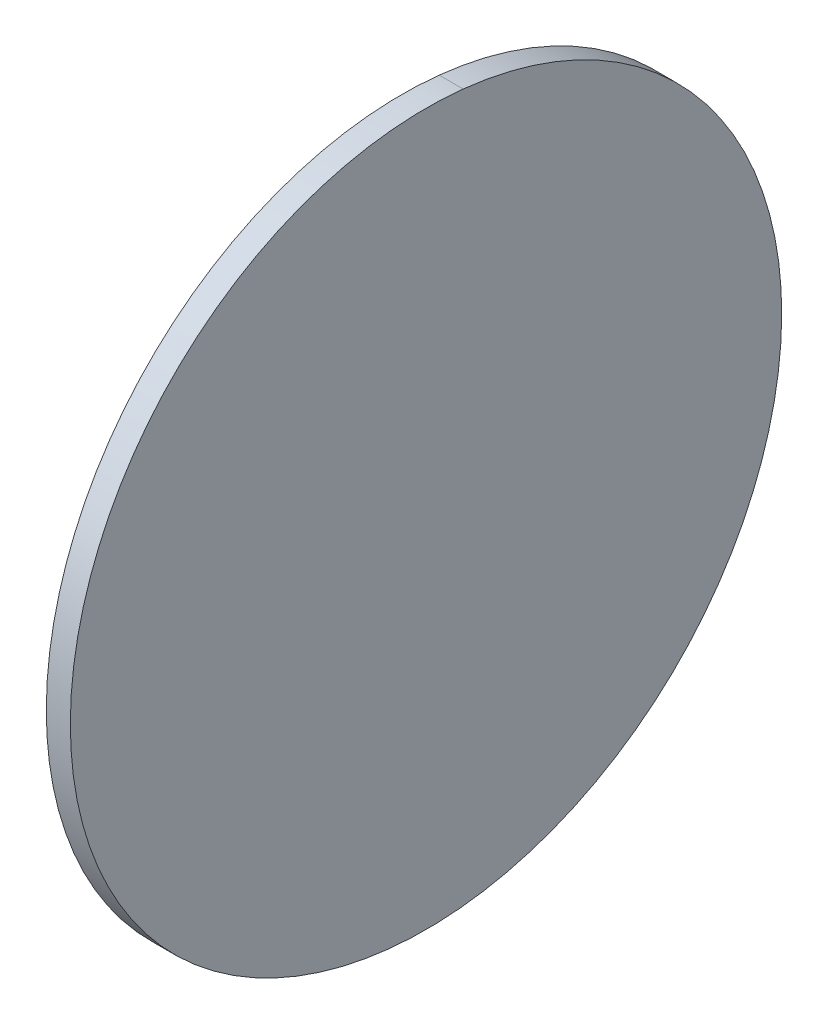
ISO-10303-21;
HEADER;
FILE_DESCRIPTION(('STEP AP214'),'2;1');
FILE_NAME('part.step','',(''),(''),'','','');
FILE_SCHEMA(('AUTOMOTIVE_DESIGN { 1 0 10303 214 1 1 1 1 }'));
ENDSEC;
DATA;
#1=APPLICATION_CONTEXT('core data for automotive mechanical design processes');
#2=APPLICATION_PROTOCOL_DEFINITION('international standard','automotive_design',2000,#1);
#3=PRODUCT_CONTEXT('',#1,'mechanical');
#4=PRODUCT('Part','Part','',(#3));
#5=PRODUCT_RELATED_PRODUCT_CATEGORY('part','',(#4));
#6=PRODUCT_DEFINITION_FORMATION('','',#4);
#7=PRODUCT_DEFINITION_CONTEXT('part definition',#1,'design');
#8=PRODUCT_DEFINITION('design','',#6,#7);
#9=PRODUCT_DEFINITION_SHAPE('','',#8);
#10=(LENGTH_UNIT() NAMED_UNIT(*) SI_UNIT(.MILLI.,.METRE.));
#11=(NAMED_UNIT(*) PLANE_ANGLE_UNIT() SI_UNIT($,.RADIAN.));
#12=(NAMED_UNIT(*) SI_UNIT($,.STERADIAN.) SOLID_ANGLE_UNIT());
#13=UNCERTAINTY_MEASURE_WITH_UNIT(LENGTH_MEASURE(1.E-05),#10,'distance_accuracy_value','');
#14=(GEOMETRIC_REPRESENTATION_CONTEXT(3) GLOBAL_UNCERTAINTY_ASSIGNED_CONTEXT((#13)) GLOBAL_UNIT_ASSIGNED_CONTEXT((#10,
#11,#12)) REPRESENTATION_CONTEXT('',''));
#15=CARTESIAN_POINT('',(0.,0.,0.));
#16=DIRECTION('',(0.,0.,1.));
#17=DIRECTION('',(1.,0.,0.));
#18=AXIS2_PLACEMENT_3D('',#15,#16,#17);
#19=CARTESIAN_POINT('',(82.1,0.,0.));
#20=DIRECTION('',(-1.,0.,0.));
#21=DIRECTION('',(0.,0.994521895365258,-0.104528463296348));
#22=AXIS2_PLACEMENT_3D('',#19,#20,#21);
#23=CYLINDRICAL_SURFACE('',#22,7.4);
#24=DIRECTION('',(-1.,0.,0.));
#25=VECTOR('',#24,1.);
#26=CARTESIAN_POINT('',(82.1,7.35946202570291,-0.773510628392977));
#27=LINE('',#26,#25);
#28=CARTESIAN_POINT('',(82.35,7.35946202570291,-0.773510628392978));
#29=VERTEX_POINT('',#28);
#30=CARTESIAN_POINT('',(81.85,7.35946202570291,-0.773510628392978));
#31=VERTEX_POINT('',#30);
#32=EDGE_CURVE('E11',#29,#31,#27,.T.);
#33=ORIENTED_EDGE('',*,*,#32,.F.);
#34=CARTESIAN_POINT('',(82.35,0.,0.));
#35=DIRECTION('',(1.,0.,0.));
#36=DIRECTION('',(0.,0.994521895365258,-0.104528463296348));
#37=AXIS2_PLACEMENT_3D('',#34,#35,#36);
#38=CIRCLE('',#37,7.4);
#39=CARTESIAN_POINT('',(82.35,-7.35946202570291,0.773510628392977));
#40=VERTEX_POINT('',#39);
#41=EDGE_CURVE('E37',#40,#29,#38,.T.);
#42=ORIENTED_EDGE('',*,*,#41,.F.);
#43=DIRECTION('',(1.,0.,0.));
#44=VECTOR('',#43,1.);
#45=CARTESIAN_POINT('',(82.1,-7.35946202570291,0.773510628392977));
#46=LINE('',#45,#44);
#47=CARTESIAN_POINT('',(81.85,-7.35946202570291,0.773510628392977));
#48=VERTEX_POINT('',#47);
#49=EDGE_CURVE('E20',#48,#40,#46,.T.);
#50=ORIENTED_EDGE('',*,*,#49,.F.);
#51=CARTESIAN_POINT('',(81.85,0.,0.));
#52=DIRECTION('',(-1.,0.,0.));
#53=DIRECTION('',(0.,0.994521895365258,-0.104528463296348));
#54=AXIS2_PLACEMENT_3D('',#51,#52,#53);
#55=CIRCLE('',#54,7.4);
#56=EDGE_CURVE('E53',#31,#48,#55,.T.);
#57=ORIENTED_EDGE('',*,*,#56,.F.);
#58=EDGE_LOOP('',(#33,#42,#50,#57));
#59=FACE_BOUND('',#58,.T.);
#60=ADVANCED_FACE('F16',(#59),#23,.T.);
#61=CARTESIAN_POINT('',(82.1,0.,0.));
#62=DIRECTION('',(-1.,0.,0.));
#63=DIRECTION('',(0.,0.994521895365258,-0.104528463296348));
#64=AXIS2_PLACEMENT_3D('',#61,#62,#63);
#65=CYLINDRICAL_SURFACE('',#64,7.4);
#66=ORIENTED_EDGE('',*,*,#32,.T.);
#67=CARTESIAN_POINT('',(81.85,0.,0.));
#68=DIRECTION('',(-1.,0.,0.));
#69=DIRECTION('',(0.,0.994521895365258,-0.104528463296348));
#70=AXIS2_PLACEMENT_3D('',#67,#68,#69);
#71=CIRCLE('',#70,7.4);
#72=EDGE_CURVE('E59',#48,#31,#71,.T.);
#73=ORIENTED_EDGE('',*,*,#72,.F.);
#74=ORIENTED_EDGE('',*,*,#49,.T.);
#75=CARTESIAN_POINT('',(82.35,0.,0.));
#76=DIRECTION('',(1.,0.,0.));
#77=DIRECTION('',(0.,0.994521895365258,-0.104528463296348));
#78=AXIS2_PLACEMENT_3D('',#75,#76,#77);
#79=CIRCLE('',#78,7.4);
#80=EDGE_CURVE('E63',#29,#40,#79,.T.);
#81=ORIENTED_EDGE('',*,*,#80,.F.);
#82=EDGE_LOOP('',(#66,#73,#74,#81));
#83=FACE_BOUND('',#82,.T.);
#84=ADVANCED_FACE('F62',(#83),#65,.T.);
#85=CARTESIAN_POINT('',(82.35,0.,0.));
#86=DIRECTION('',(1.,0.,0.));
#87=DIRECTION('',(0.,1.,0.));
#88=AXIS2_PLACEMENT_3D('',#85,#86,#87);
#89=PLANE('',#88);
#90=ORIENTED_EDGE('',*,*,#80,.T.);
#91=ORIENTED_EDGE('',*,*,#41,.T.);
#92=EDGE_LOOP('',(#90,#91));
#93=FACE_BOUND('',#92,.T.);
#94=ADVANCED_FACE('F18',(#93),#89,.T.);
#95=CARTESIAN_POINT('',(81.85,0.,0.));
#96=DIRECTION('',(-1.,0.,0.));
#97=DIRECTION('',(0.,0.,1.));
#98=AXIS2_PLACEMENT_3D('',#95,#96,#97);
#99=PLANE('',#98);
#100=ORIENTED_EDGE('',*,*,#56,.T.);
#101=ORIENTED_EDGE('',*,*,#72,.T.);
#102=EDGE_LOOP('',(#100,#101));
#103=FACE_BOUND('',#102,.T.);
#104=ADVANCED_FACE('F64',(#103),#99,.T.);
#105=CLOSED_SHELL('',(#60,#84,#94,#104));
#106=MANIFOLD_SOLID_BREP('B1',#105);
#107=ADVANCED_BREP_SHAPE_REPRESENTATION('',(#18,#106),#14);
#108=SHAPE_DEFINITION_REPRESENTATION(#9,#107);
ENDSEC;
END-ISO-10303-21;
